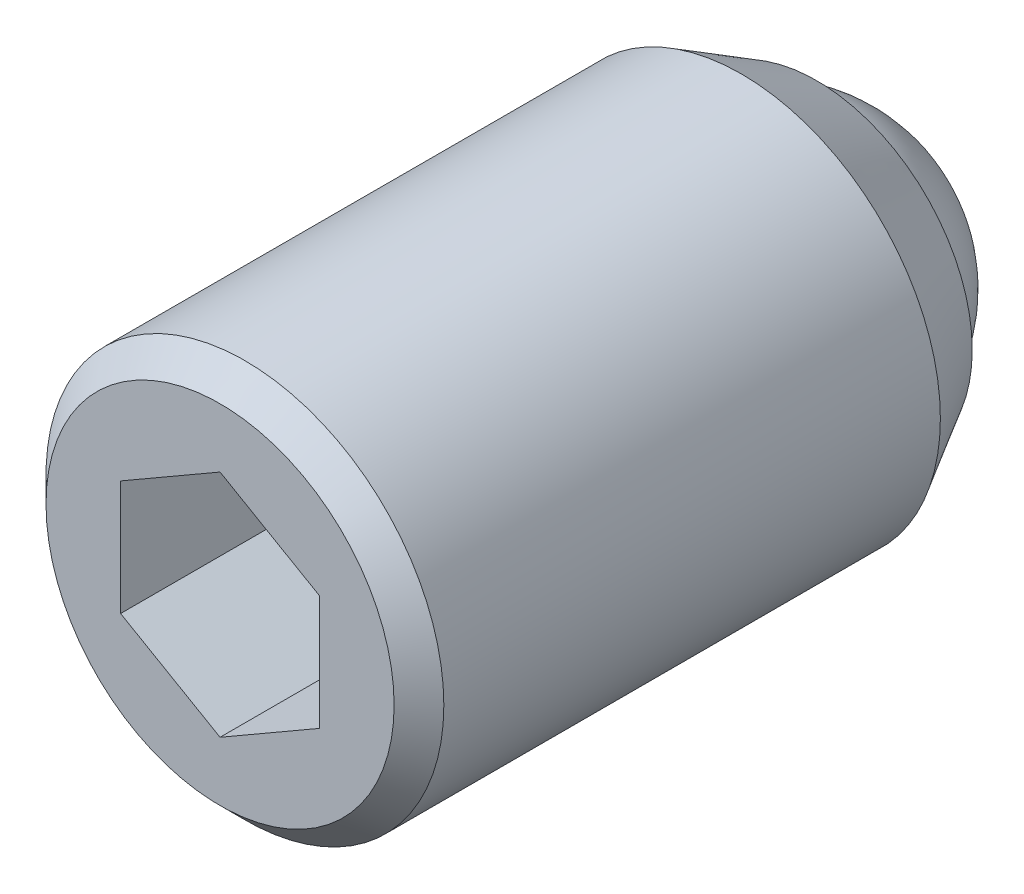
ISO-10303-21;
HEADER;
FILE_DESCRIPTION(('STEP AP214'),'2;1');
FILE_NAME('part.step','',(''),(''),'','','');
FILE_SCHEMA(('AUTOMOTIVE_DESIGN { 1 0 10303 214 1 1 1 1 }'));
ENDSEC;
DATA;
#1=APPLICATION_CONTEXT('core data for automotive mechanical design processes');
#2=APPLICATION_PROTOCOL_DEFINITION('international standard','automotive_design',2000,#1);
#3=PRODUCT_CONTEXT('',#1,'mechanical');
#4=PRODUCT('Part','Part','',(#3));
#5=PRODUCT_RELATED_PRODUCT_CATEGORY('part','',(#4));
#6=PRODUCT_DEFINITION_FORMATION('','',#4);
#7=PRODUCT_DEFINITION_CONTEXT('part definition',#1,'design');
#8=PRODUCT_DEFINITION('design','',#6,#7);
#9=PRODUCT_DEFINITION_SHAPE('','',#8);
#10=(LENGTH_UNIT() NAMED_UNIT(*) SI_UNIT(.MILLI.,.METRE.));
#11=(NAMED_UNIT(*) PLANE_ANGLE_UNIT() SI_UNIT($,.RADIAN.));
#12=(NAMED_UNIT(*) SI_UNIT($,.STERADIAN.) SOLID_ANGLE_UNIT());
#13=UNCERTAINTY_MEASURE_WITH_UNIT(LENGTH_MEASURE(1.E-05),#10,'distance_accuracy_value','');
#14=(GEOMETRIC_REPRESENTATION_CONTEXT(3) GLOBAL_UNCERTAINTY_ASSIGNED_CONTEXT((#13)) GLOBAL_UNIT_ASSIGNED_CONTEXT((#10,
#11,#12)) REPRESENTATION_CONTEXT('',''));
#15=CARTESIAN_POINT('',(0.,0.,0.));
#16=DIRECTION('',(0.,0.,1.));
#17=DIRECTION('',(1.,0.,0.));
#18=AXIS2_PLACEMENT_3D('',#15,#16,#17);
#19=CARTESIAN_POINT('',(4.,2.30940107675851,25.5));
#20=DIRECTION('',(0.5,0.86602540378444,0.));
#21=DIRECTION('',(0.86602540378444,-0.5,0.));
#22=AXIS2_PLACEMENT_3D('',#19,#20,#21);
#23=PLANE('',#22);
#24=DIRECTION('',(0.,0.,1.));
#25=VECTOR('',#24,1.);
#26=CARTESIAN_POINT('',(4.,2.30940107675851,25.5));
#27=LINE('',#26,#25);
#28=CARTESIAN_POINT('',(4.,2.30940107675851,22.));
#29=VERTEX_POINT('',#28);
#30=CARTESIAN_POINT('',(4.,2.30940107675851,28.));
#31=VERTEX_POINT('',#30);
#32=EDGE_CURVE('E68',#29,#31,#27,.T.);
#33=ORIENTED_EDGE('',*,*,#32,.T.);
#34=DIRECTION('',(-0.86602540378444,0.5,0.));
#35=VECTOR('',#34,1.);
#36=CARTESIAN_POINT('',(4.,2.30940107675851,28.));
#37=LINE('',#36,#35);
#38=CARTESIAN_POINT('',(0.,4.618802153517,28.));
#39=VERTEX_POINT('',#38);
#40=EDGE_CURVE('E29',#31,#39,#37,.T.);
#41=ORIENTED_EDGE('',*,*,#40,.T.);
#42=DIRECTION('',(0.,0.,1.));
#43=VECTOR('',#42,1.);
#44=CARTESIAN_POINT('',(0.,4.618802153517,25.5));
#45=LINE('',#44,#43);
#46=CARTESIAN_POINT('',(0.,4.618802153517,22.));
#47=VERTEX_POINT('',#46);
#48=EDGE_CURVE('E80',#47,#39,#45,.T.);
#49=ORIENTED_EDGE('',*,*,#48,.F.);
#50=DIRECTION('',(-0.86602540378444,0.5,0.));
#51=VECTOR('',#50,1.);
#52=CARTESIAN_POINT('',(4.,2.30940107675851,22.));
#53=LINE('',#52,#51);
#54=EDGE_CURVE('E79',#29,#47,#53,.T.);
#55=ORIENTED_EDGE('',*,*,#54,.F.);
#56=EDGE_LOOP('',(#33,#41,#49,#55));
#57=FACE_BOUND('',#56,.T.);
#58=ADVANCED_FACE('F14',(#57),#23,.F.);
#59=CARTESIAN_POINT('',(4.,-2.30940107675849,25.5));
#60=DIRECTION('',(1.,0.,0.));
#61=DIRECTION('',(0.,-1.,0.));
#62=AXIS2_PLACEMENT_3D('',#59,#60,#61);
#63=PLANE('',#62);
#64=DIRECTION('',(0.,0.,1.));
#65=VECTOR('',#64,1.);
#66=CARTESIAN_POINT('',(4.,-2.30940107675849,25.5));
#67=LINE('',#66,#65);
#68=CARTESIAN_POINT('',(4.,-2.30940107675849,22.));
#69=VERTEX_POINT('',#68);
#70=CARTESIAN_POINT('',(4.,-2.30940107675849,28.));
#71=VERTEX_POINT('',#70);
#72=EDGE_CURVE('E76',#69,#71,#67,.T.);
#73=ORIENTED_EDGE('',*,*,#72,.T.);
#74=DIRECTION('',(0.,1.,0.));
#75=VECTOR('',#74,1.);
#76=CARTESIAN_POINT('',(4.,-2.30940107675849,28.));
#77=LINE('',#76,#75);
#78=EDGE_CURVE('E75',#71,#31,#77,.T.);
#79=ORIENTED_EDGE('',*,*,#78,.T.);
#80=ORIENTED_EDGE('',*,*,#32,.F.);
#81=DIRECTION('',(0.,1.,0.));
#82=VECTOR('',#81,1.);
#83=CARTESIAN_POINT('',(4.,-2.30940107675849,22.));
#84=LINE('',#83,#82);
#85=EDGE_CURVE('E72',#69,#29,#84,.T.);
#86=ORIENTED_EDGE('',*,*,#85,.F.);
#87=EDGE_LOOP('',(#73,#79,#80,#86));
#88=FACE_BOUND('',#87,.T.);
#89=ADVANCED_FACE('F70',(#88),#63,.F.);
#90=CARTESIAN_POINT('',(4.,-2.30940107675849,25.5));
#91=DIRECTION('',(-0.5,0.866025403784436,0.));
#92=DIRECTION('',(0.866025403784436,0.5,0.));
#93=AXIS2_PLACEMENT_3D('',#90,#91,#92);
#94=PLANE('',#93);
#95=DIRECTION('',(0.,0.,1.));
#96=VECTOR('',#95,1.);
#97=CARTESIAN_POINT('',(0.,-4.61880215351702,25.5));
#98=LINE('',#97,#96);
#99=CARTESIAN_POINT('',(0.,-4.61880215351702,22.));
#100=VERTEX_POINT('',#99);
#101=CARTESIAN_POINT('',(0.,-4.61880215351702,28.));
#102=VERTEX_POINT('',#101);
#103=EDGE_CURVE('E122',#100,#102,#98,.T.);
#104=ORIENTED_EDGE('',*,*,#103,.T.);
#105=DIRECTION('',(-0.866025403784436,-0.5,0.));
#106=VECTOR('',#105,1.);
#107=CARTESIAN_POINT('',(4.,-2.30940107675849,28.));
#108=LINE('',#107,#106);
#109=EDGE_CURVE('E113',#71,#102,#108,.T.);
#110=ORIENTED_EDGE('',*,*,#109,.F.);
#111=ORIENTED_EDGE('',*,*,#72,.F.);
#112=DIRECTION('',(0.866025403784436,0.5,0.));
#113=VECTOR('',#112,1.);
#114=CARTESIAN_POINT('',(0.,-4.61880215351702,22.));
#115=LINE('',#114,#113);
#116=EDGE_CURVE('E89',#100,#69,#115,.T.);
#117=ORIENTED_EDGE('',*,*,#116,.F.);
#118=EDGE_LOOP('',(#104,#110,#111,#117));
#119=FACE_BOUND('',#118,.T.);
#120=ADVANCED_FACE('F147',(#119),#94,.T.);
#121=CARTESIAN_POINT('',(-4.,-2.30940107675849,25.5));
#122=DIRECTION('',(-0.5,-0.866025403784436,0.));
#123=DIRECTION('',(-0.866025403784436,0.5,0.));
#124=AXIS2_PLACEMENT_3D('',#121,#122,#123);
#125=PLANE('',#124);
#126=DIRECTION('',(0.,0.,1.));
#127=VECTOR('',#126,1.);
#128=CARTESIAN_POINT('',(-4.,-2.30940107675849,25.5));
#129=LINE('',#128,#127);
#130=CARTESIAN_POINT('',(-4.,-2.30940107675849,22.));
#131=VERTEX_POINT('',#130);
#132=CARTESIAN_POINT('',(-4.,-2.30940107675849,28.));
#133=VERTEX_POINT('',#132);
#134=EDGE_CURVE('E120',#131,#133,#129,.T.);
#135=ORIENTED_EDGE('',*,*,#134,.T.);
#136=DIRECTION('',(0.866025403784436,-0.5,0.));
#137=VECTOR('',#136,1.);
#138=CARTESIAN_POINT('',(-4.,-2.30940107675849,28.));
#139=LINE('',#138,#137);
#140=EDGE_CURVE('E111',#133,#102,#139,.T.);
#141=ORIENTED_EDGE('',*,*,#140,.T.);
#142=ORIENTED_EDGE('',*,*,#103,.F.);
#143=DIRECTION('',(0.866025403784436,-0.5,0.));
#144=VECTOR('',#143,1.);
#145=CARTESIAN_POINT('',(-4.,-2.30940107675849,22.));
#146=LINE('',#145,#144);
#147=EDGE_CURVE('E101',#131,#100,#146,.T.);
#148=ORIENTED_EDGE('',*,*,#147,.F.);
#149=EDGE_LOOP('',(#135,#141,#142,#148));
#150=FACE_BOUND('',#149,.T.);
#151=ADVANCED_FACE('F157',(#150),#125,.F.);
#152=CARTESIAN_POINT('',(-4.,-2.30940107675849,25.5));
#153=DIRECTION('',(1.,0.,0.));
#154=DIRECTION('',(0.,-1.,0.));
#155=AXIS2_PLACEMENT_3D('',#152,#153,#154);
#156=PLANE('',#155);
#157=DIRECTION('',(0.,0.,1.));
#158=VECTOR('',#157,1.);
#159=CARTESIAN_POINT('',(-4.,2.30940107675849,25.5));
#160=LINE('',#159,#158);
#161=CARTESIAN_POINT('',(-4.,2.30940107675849,22.));
#162=VERTEX_POINT('',#161);
#163=CARTESIAN_POINT('',(-4.,2.30940107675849,28.));
#164=VERTEX_POINT('',#163);
#165=EDGE_CURVE('E37',#162,#164,#160,.T.);
#166=ORIENTED_EDGE('',*,*,#165,.T.);
#167=DIRECTION('',(0.,1.,0.));
#168=VECTOR('',#167,1.);
#169=CARTESIAN_POINT('',(-4.,-2.30940107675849,28.));
#170=LINE('',#169,#168);
#171=EDGE_CURVE('E108',#133,#164,#170,.T.);
#172=ORIENTED_EDGE('',*,*,#171,.F.);
#173=ORIENTED_EDGE('',*,*,#134,.F.);
#174=DIRECTION('',(0.,-1.,0.));
#175=VECTOR('',#174,1.);
#176=CARTESIAN_POINT('',(-4.,2.30940107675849,22.));
#177=LINE('',#176,#175);
#178=EDGE_CURVE('E98',#162,#131,#177,.T.);
#179=ORIENTED_EDGE('',*,*,#178,.F.);
#180=EDGE_LOOP('',(#166,#172,#173,#179));
#181=FACE_BOUND('',#180,.T.);
#182=ADVANCED_FACE('F153',(#181),#156,.T.);
#183=CARTESIAN_POINT('',(-4.,2.30940107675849,25.5));
#184=DIRECTION('',(0.5,-0.866025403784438,0.));
#185=DIRECTION('',(-0.866025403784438,-0.5,0.));
#186=AXIS2_PLACEMENT_3D('',#183,#184,#185);
#187=PLANE('',#186);
#188=ORIENTED_EDGE('',*,*,#165,.F.);
#189=DIRECTION('',(-0.866025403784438,-0.5,0.));
#190=VECTOR('',#189,1.);
#191=CARTESIAN_POINT('',(0.,4.618802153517,22.));
#192=LINE('',#191,#190);
#193=EDGE_CURVE('E84',#47,#162,#192,.T.);
#194=ORIENTED_EDGE('',*,*,#193,.F.);
#195=ORIENTED_EDGE('',*,*,#48,.T.);
#196=DIRECTION('',(0.866025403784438,0.5,0.));
#197=VECTOR('',#196,1.);
#198=CARTESIAN_POINT('',(-4.,2.30940107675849,28.));
#199=LINE('',#198,#197);
#200=EDGE_CURVE('E105',#164,#39,#199,.T.);
#201=ORIENTED_EDGE('',*,*,#200,.F.);
#202=EDGE_LOOP('',(#188,#194,#195,#201));
#203=FACE_BOUND('',#202,.T.);
#204=ADVANCED_FACE('F150',(#203),#187,.T.);
#205=CARTESIAN_POINT('',(0.,0.,27.75));
#206=DIRECTION('',(0.,0.,-1.));
#207=DIRECTION('',(1.,0.,0.));
#208=AXIS2_PLACEMENT_3D('',#205,#206,#207);
#209=CYLINDRICAL_SURFACE('',#208,8.);
#210=CARTESIAN_POINT('',(0.,0.,27.));
#211=DIRECTION('',(0.,0.,-1.));
#212=DIRECTION('',(1.,0.,0.));
#213=AXIS2_PLACEMENT_3D('',#210,#211,#212);
#214=CIRCLE('',#213,8.);
#215=CARTESIAN_POINT('',(8.,0.,27.));
#216=VERTEX_POINT('',#215);
#217=EDGE_CURVE('E9',#216,#216,#214,.T.);
#218=ORIENTED_EDGE('',*,*,#217,.T.);
#219=EDGE_LOOP('',(#218));
#220=FACE_BOUND('',#219,.T.);
#221=CARTESIAN_POINT('',(0.,0.,7.03108891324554));
#222=DIRECTION('',(0.,0.,-1.));
#223=DIRECTION('',(-1.,0.,0.));
#224=AXIS2_PLACEMENT_3D('',#221,#222,#223);
#225=CIRCLE('',#224,8.);
#226=CARTESIAN_POINT('',(-8.,0.,7.03108891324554));
#227=VERTEX_POINT('',#226);
#228=EDGE_CURVE('E244',#227,#227,#225,.T.);
#229=ORIENTED_EDGE('',*,*,#228,.F.);
#230=EDGE_LOOP('',(#229));
#231=FACE_BOUND('',#230,.T.);
#232=ADVANCED_FACE('F16',(#220,#231),#209,.T.);
#233=CARTESIAN_POINT('',(0.,0.,27.));
#234=DIRECTION('',(0.,0.,-1.));
#235=DIRECTION('',(1.,0.,0.));
#236=AXIS2_PLACEMENT_3D('',#233,#234,#235);
#237=CONICAL_SURFACE('',#236,8.,0.785398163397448);
#238=CARTESIAN_POINT('',(0.,0.,28.));
#239=DIRECTION('',(0.,0.,-1.));
#240=DIRECTION('',(1.,0.,0.));
#241=AXIS2_PLACEMENT_3D('',#238,#239,#240);
#242=CIRCLE('',#241,7.);
#243=CARTESIAN_POINT('',(7.,0.,28.));
#244=VERTEX_POINT('',#243);
#245=EDGE_CURVE('E22',#244,#244,#242,.T.);
#246=ORIENTED_EDGE('',*,*,#245,.T.);
#247=EDGE_LOOP('',(#246));
#248=FACE_BOUND('',#247,.T.);
#249=ORIENTED_EDGE('',*,*,#217,.F.);
#250=EDGE_LOOP('',(#249));
#251=FACE_BOUND('',#250,.T.);
#252=ADVANCED_FACE('F127',(#248,#251),#237,.T.);
#253=CARTESIAN_POINT('',(0.,0.,28.));
#254=DIRECTION('',(0.,0.,-1.));
#255=DIRECTION('',(1.,0.,0.));
#256=AXIS2_PLACEMENT_3D('',#253,#254,#255);
#257=PLANE('',#256);
#258=ORIENTED_EDGE('',*,*,#200,.T.);
#259=ORIENTED_EDGE('',*,*,#40,.F.);
#260=ORIENTED_EDGE('',*,*,#78,.F.);
#261=ORIENTED_EDGE('',*,*,#109,.T.);
#262=ORIENTED_EDGE('',*,*,#140,.F.);
#263=ORIENTED_EDGE('',*,*,#171,.T.);
#264=EDGE_LOOP('',(#258,#259,#260,#261,#262,#263));
#265=FACE_BOUND('',#264,.T.);
#266=ORIENTED_EDGE('',*,*,#245,.F.);
#267=EDGE_LOOP('',(#266));
#268=FACE_BOUND('',#267,.T.);
#269=ADVANCED_FACE('F130',(#265,#268),#257,.F.);
#270=CARTESIAN_POINT('',(4.,2.30940107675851,22.));
#271=DIRECTION('',(0.,0.,1.));
#272=DIRECTION('',(1.,0.,0.));
#273=AXIS2_PLACEMENT_3D('',#270,#271,#272);
#274=PLANE('',#273);
#275=ORIENTED_EDGE('',*,*,#85,.T.);
#276=ORIENTED_EDGE('',*,*,#54,.T.);
#277=ORIENTED_EDGE('',*,*,#193,.T.);
#278=ORIENTED_EDGE('',*,*,#178,.T.);
#279=ORIENTED_EDGE('',*,*,#147,.T.);
#280=ORIENTED_EDGE('',*,*,#116,.T.);
#281=EDGE_LOOP('',(#275,#276,#277,#278,#279,#280));
#282=FACE_BOUND('',#281,.T.);
#283=ADVANCED_FACE('F86',(#282),#274,.T.);
#284=CARTESIAN_POINT('',(0.,0.,6.));
#285=DIRECTION('',(0.,0.,-1.));
#286=DIRECTION('',(-1.,0.,0.));
#287=AXIS2_PLACEMENT_3D('',#284,#285,#286);
#288=SPHERICAL_SURFACE('',#287,6.);
#289=CARTESIAN_POINT('',(0.,0.,4.));
#290=DIRECTION('',(0.,0.,-1.));
#291=DIRECTION('',(-1.,0.,0.));
#292=AXIS2_PLACEMENT_3D('',#289,#290,#291);
#293=CIRCLE('',#292,5.65685424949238);
#294=CARTESIAN_POINT('',(-5.65685424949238,0.,4.));
#295=VERTEX_POINT('',#294);
#296=EDGE_CURVE('E90',#295,#295,#293,.T.);
#297=ORIENTED_EDGE('',*,*,#296,.T.);
#298=EDGE_LOOP('',(#297));
#299=FACE_BOUND('',#298,.T.);
#300=ADVANCED_FACE('F139',(#299),#288,.T.);
#301=CARTESIAN_POINT('',(-5.65685424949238,0.,4.));
#302=DIRECTION('',(0.,0.,-1.));
#303=DIRECTION('',(-1.,0.,0.));
#304=AXIS2_PLACEMENT_3D('',#301,#302,#303);
#305=PLANE('',#304);
#306=CARTESIAN_POINT('',(0.,0.,4.));
#307=DIRECTION('',(0.,0.,-1.));
#308=DIRECTION('',(-1.,0.,0.));
#309=AXIS2_PLACEMENT_3D('',#306,#307,#308);
#310=CIRCLE('',#309,6.25);
#311=CARTESIAN_POINT('',(-6.25,0.,4.));
#312=VERTEX_POINT('',#311);
#313=EDGE_CURVE('E93',#312,#312,#310,.T.);
#314=ORIENTED_EDGE('',*,*,#313,.T.);
#315=EDGE_LOOP('',(#314));
#316=FACE_BOUND('',#315,.T.);
#317=ORIENTED_EDGE('',*,*,#296,.F.);
#318=EDGE_LOOP('',(#317));
#319=FACE_BOUND('',#318,.T.);
#320=ADVANCED_FACE('F216',(#316,#319),#305,.T.);
#321=CARTESIAN_POINT('',(0.,0.,4.));
#322=DIRECTION('',(0.,0.,1.));
#323=DIRECTION('',(1.,0.,0.));
#324=AXIS2_PLACEMENT_3D('',#321,#322,#323);
#325=CONICAL_SURFACE('',#324,6.25,0.523598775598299);
#326=ORIENTED_EDGE('',*,*,#228,.T.);
#327=EDGE_LOOP('',(#326));
#328=FACE_BOUND('',#327,.T.);
#329=ORIENTED_EDGE('',*,*,#313,.F.);
#330=EDGE_LOOP('',(#329));
#331=FACE_BOUND('',#330,.T.);
#332=ADVANCED_FACE('F225',(#328,#331),#325,.T.);
#333=CLOSED_SHELL('',(#58,#89,#120,#151,#182,#204,#232,#252,#269,#283,#300,#320,#332));
#334=MANIFOLD_SOLID_BREP('B1',#333);
#335=ADVANCED_BREP_SHAPE_REPRESENTATION('',(#18,#334),#14);
#336=SHAPE_DEFINITION_REPRESENTATION(#9,#335);
ENDSEC;
END-ISO-10303-21;
